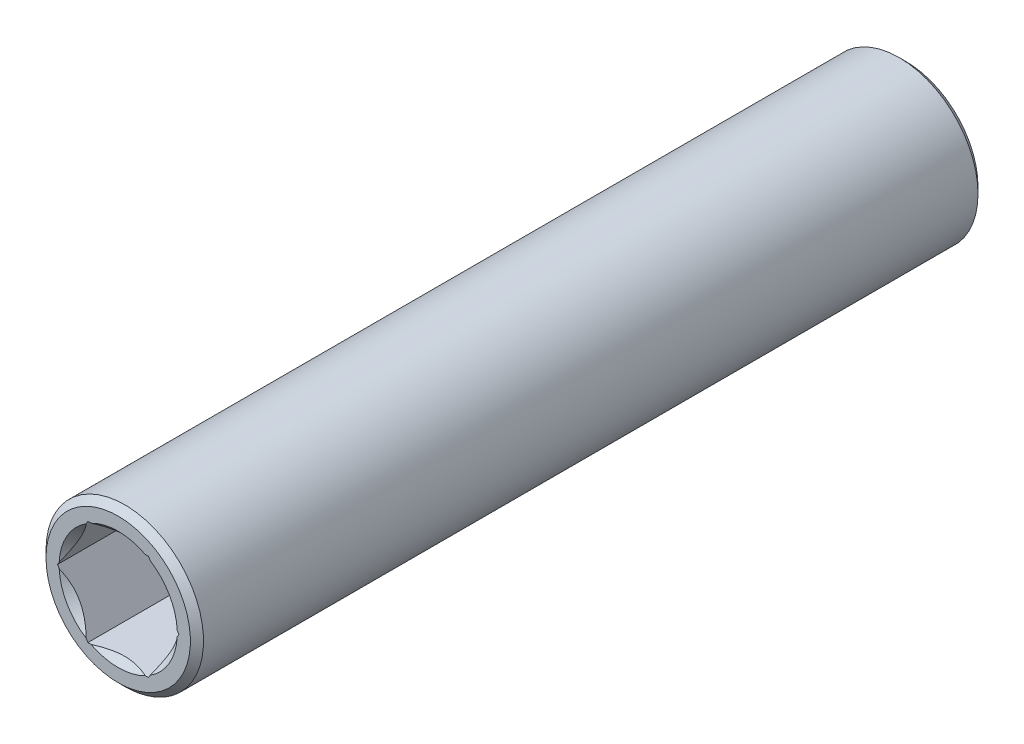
ISO-10303-21;
HEADER;
FILE_DESCRIPTION(('STEP AP214'),'2;1');
FILE_NAME('part.step','',(''),(''),'','','');
FILE_SCHEMA(('AUTOMOTIVE_DESIGN { 1 0 10303 214 1 1 1 1 }'));
ENDSEC;
DATA;
#1=APPLICATION_CONTEXT('core data for automotive mechanical design processes');
#2=APPLICATION_PROTOCOL_DEFINITION('international standard','automotive_design',2000,#1);
#3=PRODUCT_CONTEXT('',#1,'mechanical');
#4=PRODUCT('Part','Part','',(#3));
#5=PRODUCT_RELATED_PRODUCT_CATEGORY('part','',(#4));
#6=PRODUCT_DEFINITION_FORMATION('','',#4);
#7=PRODUCT_DEFINITION_CONTEXT('part definition',#1,'design');
#8=PRODUCT_DEFINITION('design','',#6,#7);
#9=PRODUCT_DEFINITION_SHAPE('','',#8);
#10=(LENGTH_UNIT() NAMED_UNIT(*) SI_UNIT(.MILLI.,.METRE.));
#11=(NAMED_UNIT(*) PLANE_ANGLE_UNIT() SI_UNIT($,.RADIAN.));
#12=(NAMED_UNIT(*) SI_UNIT($,.STERADIAN.) SOLID_ANGLE_UNIT());
#13=UNCERTAINTY_MEASURE_WITH_UNIT(LENGTH_MEASURE(1.E-05),#10,'distance_accuracy_value','');
#14=(GEOMETRIC_REPRESENTATION_CONTEXT(3) GLOBAL_UNCERTAINTY_ASSIGNED_CONTEXT((#13)) GLOBAL_UNIT_ASSIGNED_CONTEXT((#10,
#11,#12)) REPRESENTATION_CONTEXT('',''));
#15=CARTESIAN_POINT('',(0.,0.,0.));
#16=DIRECTION('',(0.,0.,1.));
#17=DIRECTION('',(1.,0.,0.));
#18=AXIS2_PLACEMENT_3D('',#15,#16,#17);
#19=CARTESIAN_POINT('',(0.,0.,0.));
#20=DIRECTION('',(0.,0.,-1.));
#21=DIRECTION('',(-1.,0.,0.));
#22=AXIS2_PLACEMENT_3D('',#19,#20,#21);
#23=CYLINDRICAL_SURFACE('',#22,2.5);
#24=CARTESIAN_POINT('',(0.,0.,-30.));
#25=DIRECTION('',(0.,0.,-1.));
#26=DIRECTION('',(-1.,0.,0.));
#27=AXIS2_PLACEMENT_3D('',#24,#25,#26);
#28=CIRCLE('',#27,2.5);
#29=CARTESIAN_POINT('',(-2.5,0.,-30.));
#30=VERTEX_POINT('',#29);
#31=EDGE_CURVE('P0_E15',#30,#30,#28,.F.);
#32=ORIENTED_EDGE('',*,*,#31,.T.);
#33=EDGE_LOOP('',(#32));
#34=FACE_BOUND('',#33,.T.);
#35=CARTESIAN_POINT('',(0.,0.,0.));
#36=DIRECTION('',(0.,0.,-1.));
#37=DIRECTION('',(-1.,0.,0.));
#38=AXIS2_PLACEMENT_3D('',#35,#36,#37);
#39=CIRCLE('',#38,2.5);
#40=CARTESIAN_POINT('',(-2.5,0.,0.));
#41=VERTEX_POINT('',#40);
#42=EDGE_CURVE('P0_E10',#41,#41,#39,.T.);
#43=ORIENTED_EDGE('',*,*,#42,.T.);
#44=EDGE_LOOP('',(#43));
#45=FACE_BOUND('',#44,.T.);
#46=ADVANCED_FACE('P0_F14',(#34,#45),#23,.T.);
#47=OPEN_SHELL('',(#46));
#48=SHELL_BASED_SURFACE_MODEL('P0_B1',(#47));
#49=CARTESIAN_POINT('',(0.,0.,-4.));
#50=DIRECTION('',(0.,0.,1.));
#51=DIRECTION('',(1.,0.,0.));
#52=AXIS2_PLACEMENT_3D('',#49,#50,#51);
#53=PLANE('',#52);
#54=DIRECTION('',(-0.500000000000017,-0.866025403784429,0.));
#55=VECTOR('',#54,1.);
#56=CARTESIAN_POINT('',(-1.154700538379,2.,-4.));
#57=LINE('',#56,#55);
#58=CARTESIAN_POINT('',(-1.154700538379,2.,-4.));
#59=VERTEX_POINT('',#58);
#60=CARTESIAN_POINT('',(-2.30940107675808,0.,-4.));
#61=VERTEX_POINT('',#60);
#62=EDGE_CURVE('P1_E411',#59,#61,#57,.T.);
#63=ORIENTED_EDGE('',*,*,#62,.T.);
#64=DIRECTION('',(0.500000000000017,-0.866025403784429,0.));
#65=VECTOR('',#64,1.);
#66=CARTESIAN_POINT('',(-2.309401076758,0.,-4.));
#67=LINE('',#66,#65);
#68=CARTESIAN_POINT('',(-1.15470053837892,-1.99999999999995,-4.));
#69=VERTEX_POINT('',#68);
#70=EDGE_CURVE('P1_E177',#61,#69,#67,.T.);
#71=ORIENTED_EDGE('',*,*,#70,.T.);
#72=DIRECTION('',(1.,0.,0.));
#73=VECTOR('',#72,1.);
#74=CARTESIAN_POINT('',(-1.154700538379,-2.,-4.));
#75=LINE('',#74,#73);
#76=CARTESIAN_POINT('',(1.154700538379,-2.,-4.));
#77=VERTEX_POINT('',#76);
#78=EDGE_CURVE('P1_E166',#69,#77,#75,.T.);
#79=ORIENTED_EDGE('',*,*,#78,.T.);
#80=DIRECTION('',(0.500000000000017,0.866025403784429,0.));
#81=VECTOR('',#80,1.);
#82=CARTESIAN_POINT('',(1.154700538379,-2.,-4.));
#83=LINE('',#82,#81);
#84=CARTESIAN_POINT('',(2.30940107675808,0.,-4.));
#85=VERTEX_POINT('',#84);
#86=EDGE_CURVE('P1_E155',#77,#85,#83,.T.);
#87=ORIENTED_EDGE('',*,*,#86,.T.);
#88=DIRECTION('',(-0.500000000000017,0.866025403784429,0.));
#89=VECTOR('',#88,1.);
#90=CARTESIAN_POINT('',(2.309401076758,0.,-4.));
#91=LINE('',#90,#89);
#92=CARTESIAN_POINT('',(1.15470053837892,1.99999999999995,-4.));
#93=VERTEX_POINT('',#92);
#94=EDGE_CURVE('P1_E133',#85,#93,#91,.T.);
#95=ORIENTED_EDGE('',*,*,#94,.T.);
#96=DIRECTION('',(1.,0.,0.));
#97=VECTOR('',#96,1.);
#98=CARTESIAN_POINT('',(1.154700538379,2.,-4.));
#99=LINE('',#98,#97);
#100=EDGE_CURVE('P1_E137',#93,#59,#99,.F.);
#101=ORIENTED_EDGE('',*,*,#100,.T.);
#102=EDGE_LOOP('',(#63,#71,#79,#87,#95,#101));
#103=FACE_BOUND('',#102,.T.);
#104=ADVANCED_FACE('P1_F16',(#103),#53,.T.);
#105=CARTESIAN_POINT('',(-1.154700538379,2.,0.));
#106=DIRECTION('',(-0.866025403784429,0.500000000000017,0.));
#107=DIRECTION('',(-0.500000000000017,-0.866025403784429,0.));
#108=AXIS2_PLACEMENT_3D('',#105,#106,#107);
#109=PLANE('',#108);
#110=DIRECTION('',(0.,0.,1.));
#111=VECTOR('',#110,1.);
#112=CARTESIAN_POINT('',(-2.309401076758,0.,0.));
#113=LINE('',#112,#111);
#114=CARTESIAN_POINT('',(-2.30940107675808,0.,0.));
#115=VERTEX_POINT('',#114);
#116=EDGE_CURVE('P1_E180',#115,#61,#113,.F.);
#117=ORIENTED_EDGE('',*,*,#116,.T.);
#118=ORIENTED_EDGE('',*,*,#62,.F.);
#119=DIRECTION('',(0.,0.,1.));
#120=VECTOR('',#119,1.);
#121=CARTESIAN_POINT('',(-1.154700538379,2.,0.));
#122=LINE('',#121,#120);
#123=CARTESIAN_POINT('',(-1.154700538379,2.,0.));
#124=VERTEX_POINT('',#123);
#125=EDGE_CURVE('P1_E139',#59,#124,#122,.T.);
#126=ORIENTED_EDGE('',*,*,#125,.T.);
#127=DIRECTION('',(-0.500000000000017,-0.866025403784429,0.));
#128=VECTOR('',#127,1.);
#129=CARTESIAN_POINT('',(-1.154700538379,2.,0.));
#130=LINE('',#129,#128);
#131=CARTESIAN_POINT('',(-1.21666260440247,1.89267855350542,2.00448068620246E-11));
#132=VERTEX_POINT('',#131);
#133=EDGE_CURVE('P1_E74',#132,#124,#130,.F.);
#134=ORIENTED_EDGE('',*,*,#133,.F.);
#135=CARTESIAN_POINT('',(-1.21666260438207,1.89267855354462,3.92484301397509E-11));
#136=CARTESIAN_POINT('',(-1.25297293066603,1.82978722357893,-0.0332570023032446));
#137=CARTESIAN_POINT('',(-1.28985399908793,1.76590733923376,-0.0642848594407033));
#138=CARTESIAN_POINT('',(-1.36486667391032,1.63598157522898,-0.120580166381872));
#139=CARTESIAN_POINT('',(-1.403002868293,1.56992774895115,-0.145822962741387));
#140=CARTESIAN_POINT('',(-1.47983157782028,1.43685652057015,-0.188665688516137));
#141=CARTESIAN_POINT('',(-1.51851057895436,1.36986252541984,-0.206359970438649));
#142=CARTESIAN_POINT('',(-1.59655412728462,1.23468713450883,-0.233183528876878));
#143=CARTESIAN_POINT('',(-1.6359173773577,1.16650798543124,-0.242327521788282));
#144=CARTESIAN_POINT('',(-1.71181499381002,1.03504945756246,-0.250912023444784));
#145=CARTESIAN_POINT('',(-1.74832931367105,0.971804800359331,-0.251056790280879));
#146=CARTESIAN_POINT('',(-1.82116408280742,0.845651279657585,-0.243393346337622));
#147=CARTESIAN_POINT('',(-1.85748441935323,0.782742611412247,-0.235580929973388));
#148=CARTESIAN_POINT('',(-1.92952738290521,0.657960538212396,-0.212618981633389));
#149=CARTESIAN_POINT('',(-1.96524999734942,0.596087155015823,-0.197469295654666));
#150=CARTESIAN_POINT('',(-2.03587686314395,0.473757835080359,-0.16084210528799));
#151=CARTESIAN_POINT('',(-2.07078077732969,0.41330248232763,-0.139362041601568));
#152=CARTESIAN_POINT('',(-2.12941916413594,0.311737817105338,-0.0983618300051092));
#153=CARTESIAN_POINT('',(-2.15338910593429,0.270220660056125,-0.0801577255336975));
#154=CARTESIAN_POINT('',(-2.20079057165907,0.18811891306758,-0.0416056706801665));
#155=CARTESIAN_POINT('',(-2.22422377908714,0.147531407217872,-0.021266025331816));
#156=CARTESIAN_POINT('',(-2.24743901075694,0.107321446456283,3.99436300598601E-11));
#157=B_SPLINE_CURVE_WITH_KNOTS('',3,(#135,#136,#137,#138,#139,#140,#141,#142,#143,#144,#145,
#146,#147,#148,#149,#150,#151,#152,#153,#154,#155,#156),.UNSPECIFIED.,.F.,.F.,(4,2,2,2,2,2,2,2,
2,2,4),(0.,0.239748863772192,0.480501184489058,0.718149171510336,0.955387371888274,
1.17403444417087,1.39279713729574,1.6115644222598,1.83042027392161,1.98420700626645,
2.13741638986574),.UNSPECIFIED.);
#158=CARTESIAN_POINT('',(-2.24743901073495,0.107321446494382,2.00795536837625E-11));
#159=VERTEX_POINT('',#158);
#160=EDGE_CURVE('P1_E19',#132,#159,#157,.T.);
#161=ORIENTED_EDGE('',*,*,#160,.T.);
#162=DIRECTION('',(-0.500000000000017,-0.866025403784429,0.));
#163=VECTOR('',#162,1.);
#164=CARTESIAN_POINT('',(-1.154700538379,2.,0.));
#165=LINE('',#164,#163);
#166=EDGE_CURVE('P1_E413',#115,#159,#165,.F.);
#167=ORIENTED_EDGE('',*,*,#166,.F.);
#168=EDGE_LOOP('',(#117,#118,#126,#134,#161,#167));
#169=FACE_BOUND('',#168,.T.);
#170=ADVANCED_FACE('P1_F271',(#169),#109,.F.);
#171=CARTESIAN_POINT('',(-2.309401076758,0.,0.));
#172=DIRECTION('',(-0.866025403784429,-0.500000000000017,0.));
#173=DIRECTION('',(0.500000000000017,-0.866025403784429,0.));
#174=AXIS2_PLACEMENT_3D('',#171,#172,#173);
#175=PLANE('',#174);
#176=DIRECTION('',(0.,0.,-1.));
#177=VECTOR('',#176,1.);
#178=CARTESIAN_POINT('',(-1.154700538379,-2.,0.));
#179=LINE('',#178,#177);
#180=CARTESIAN_POINT('',(-1.15470053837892,-1.99999999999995,0.));
#181=VERTEX_POINT('',#180);
#182=EDGE_CURVE('P1_E169',#181,#69,#179,.T.);
#183=ORIENTED_EDGE('',*,*,#182,.T.);
#184=ORIENTED_EDGE('',*,*,#70,.F.);
#185=ORIENTED_EDGE('',*,*,#116,.F.);
#186=DIRECTION('',(0.500000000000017,-0.866025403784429,0.));
#187=VECTOR('',#186,1.);
#188=CARTESIAN_POINT('',(-2.309401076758,0.,0.));
#189=LINE('',#188,#187);
#190=CARTESIAN_POINT('',(-2.24743901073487,-0.107321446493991,1.99833493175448E-11));
#191=VERTEX_POINT('',#190);
#192=EDGE_CURVE('P1_E185',#191,#115,#189,.F.);
#193=ORIENTED_EDGE('',*,*,#192,.F.);
#194=CARTESIAN_POINT('',(-2.2474390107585,-0.107321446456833,3.91484602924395E-11));
#195=CARTESIAN_POINT('',(-2.21112868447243,-0.170212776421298,-0.0332570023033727));
#196=CARTESIAN_POINT('',(-2.17424761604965,-0.234092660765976,-0.0642848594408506));
#197=CARTESIAN_POINT('',(-2.09923494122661,-0.364018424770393,-0.12058016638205));
#198=CARTESIAN_POINT('',(-2.06109874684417,-0.430072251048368,-0.145822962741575));
#199=CARTESIAN_POINT('',(-1.98427003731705,-0.56314347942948,-0.188665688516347));
#200=CARTESIAN_POINT('',(-1.9455910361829,-0.63013747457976,-0.206359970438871));
#201=CARTESIAN_POINT('',(-1.86754748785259,-0.765312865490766,-0.233183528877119));
#202=CARTESIAN_POINT('',(-1.82818423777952,-0.833492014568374,-0.24232752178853));
#203=CARTESIAN_POINT('',(-1.7522866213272,-0.964950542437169,-0.250912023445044));
#204=CARTESIAN_POINT('',(-1.71577230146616,-1.0281951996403,-0.251056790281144));
#205=CARTESIAN_POINT('',(-1.64293753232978,-1.15434872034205,-0.243393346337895));
#206=CARTESIAN_POINT('',(-1.60661719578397,-1.2172573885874,-0.235580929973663));
#207=CARTESIAN_POINT('',(-1.53457423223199,-1.34203946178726,-0.212618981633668));
#208=CARTESIAN_POINT('',(-1.49885161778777,-1.40391284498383,-0.197469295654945));
#209=CARTESIAN_POINT('',(-1.42822475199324,-1.5262421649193,-0.160842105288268));
#210=CARTESIAN_POINT('',(-1.3933208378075,-1.58669751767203,-0.139362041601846));
#211=CARTESIAN_POINT('',(-1.33468245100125,-1.68826218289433,-0.0983618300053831));
#212=CARTESIAN_POINT('',(-1.31071250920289,-1.72977933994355,-0.0801577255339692));
#213=CARTESIAN_POINT('',(-1.26331104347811,-1.8118810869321,-0.0416056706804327));
#214=CARTESIAN_POINT('',(-1.23987783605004,-1.85246859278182,-0.0212660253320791));
#215=CARTESIAN_POINT('',(-1.21666260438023,-1.89267855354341,3.96839969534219E-11));
#216=B_SPLINE_CURVE_WITH_KNOTS('',3,(#194,#195,#196,#197,#198,#199,#200,#201,#202,#203,#204,
#205,#206,#207,#208,#209,#210,#211,#212,#213,#214,#215),.UNSPECIFIED.,.F.,.F.,(4,2,2,2,2,2,2,2,
2,2,4),(0.,0.239748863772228,0.48050118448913,0.718149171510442,0.955387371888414,
1.17403444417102,1.3927971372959,1.61156442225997,1.8304202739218,1.98420700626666,
2.13741638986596),.UNSPECIFIED.);
#217=CARTESIAN_POINT('',(-1.21666260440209,-1.89267855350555,1.99485061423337E-11));
#218=VERTEX_POINT('',#217);
#219=EDGE_CURVE('P1_E274',#191,#218,#216,.T.);
#220=ORIENTED_EDGE('',*,*,#219,.T.);
#221=DIRECTION('',(0.500000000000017,-0.866025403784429,0.));
#222=VECTOR('',#221,1.);
#223=CARTESIAN_POINT('',(-2.309401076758,0.,0.));
#224=LINE('',#223,#222);
#225=EDGE_CURVE('P1_E179',#181,#218,#224,.F.);
#226=ORIENTED_EDGE('',*,*,#225,.F.);
#227=EDGE_LOOP('',(#183,#184,#185,#193,#220,#226));
#228=FACE_BOUND('',#227,.T.);
#229=ADVANCED_FACE('P1_F267',(#228),#175,.F.);
#230=CARTESIAN_POINT('',(-1.154700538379,-2.,0.));
#231=DIRECTION('',(0.,-1.,0.));
#232=DIRECTION('',(0.,0.,-1.));
#233=AXIS2_PLACEMENT_3D('',#230,#231,#232);
#234=PLANE('',#233);
#235=DIRECTION('',(0.,0.,1.));
#236=VECTOR('',#235,1.);
#237=CARTESIAN_POINT('',(1.154700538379,-2.,0.));
#238=LINE('',#237,#236);
#239=CARTESIAN_POINT('',(1.154700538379,-2.,0.));
#240=VERTEX_POINT('',#239);
#241=EDGE_CURVE('P1_E158',#240,#77,#238,.F.);
#242=ORIENTED_EDGE('',*,*,#241,.T.);
#243=ORIENTED_EDGE('',*,*,#78,.F.);
#244=ORIENTED_EDGE('',*,*,#182,.F.);
#245=DIRECTION('',(1.,0.,0.));
#246=VECTOR('',#245,1.);
#247=CARTESIAN_POINT('',(-1.154700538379,-2.,0.));
#248=LINE('',#247,#246);
#249=CARTESIAN_POINT('',(-1.03077640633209,-2.,2.00700850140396E-11));
#250=VERTEX_POINT('',#249);
#251=EDGE_CURVE('P1_E174',#250,#181,#248,.F.);
#252=ORIENTED_EDGE('',*,*,#251,.F.);
#253=CARTESIAN_POINT('',(-1.03077640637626,-2.00000000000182,3.93492905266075E-11));
#254=CARTESIAN_POINT('',(-0.958155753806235,-2.00000000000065,-0.0332570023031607));
#255=CARTESIAN_POINT('',(-0.88439361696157,-2.00000000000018,-0.0642848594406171));
#256=CARTESIAN_POINT('',(-0.734368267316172,-1.99999999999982,-0.120580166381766));
#257=CARTESIAN_POINT('',(-0.658095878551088,-1.99999999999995,-0.145822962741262));
#258=CARTESIAN_POINT('',(-0.504438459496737,-2.00000000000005,-0.188665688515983));
#259=CARTESIAN_POINT('',(-0.427080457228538,-2.00000000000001,-0.206359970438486));
#260=CARTESIAN_POINT('',(-0.270993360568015,-1.99999999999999,-0.233183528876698));
#261=CARTESIAN_POINT('',(-0.192266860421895,-2.,-0.242327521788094));
#262=CARTESIAN_POINT('',(-0.0404716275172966,-2.,-0.250912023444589));
#263=CARTESIAN_POINT('',(0.0325570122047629,-2.,-0.251056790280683));
#264=CARTESIAN_POINT('',(0.178226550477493,-2.,-0.243393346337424));
#265=CARTESIAN_POINT('',(0.2508672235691,-2.,-0.235580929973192));
#266=CARTESIAN_POINT('',(0.394953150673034,-2.,-0.212618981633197));
#267=CARTESIAN_POINT('',(0.466398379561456,-2.,-0.197469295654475));
#268=CARTESIAN_POINT('',(0.607652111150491,-2.,-0.160842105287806));
#269=CARTESIAN_POINT('',(0.67745993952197,-2.,-0.139362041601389));
#270=CARTESIAN_POINT('',(0.794736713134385,-2.,-0.0983618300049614));
#271=CARTESIAN_POINT('',(0.84267659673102,-2.,-0.0801577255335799));
#272=CARTESIAN_POINT('',(0.93747952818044,-2.,-0.0416056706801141));
#273=CARTESIAN_POINT('',(0.984345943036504,-2.,-0.0212660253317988));
#274=CARTESIAN_POINT('',(1.03077640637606,-2.,3.99241774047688E-11));
#275=B_SPLINE_CURVE_WITH_KNOTS('',3,(#253,#254,#255,#256,#257,#258,#259,#260,#261,#262,#263,
#264,#265,#266,#267,#268,#269,#270,#271,#272,#273,#274),.UNSPECIFIED.,.F.,.F.,(4,2,2,2,2,2,2,2,
2,2,4),(0.,0.239748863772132,0.480501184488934,0.718149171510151,0.95538737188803,
1.1740344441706,1.39279713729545,1.61156442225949,1.83042027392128,1.9842070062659,
2.13741638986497),.UNSPECIFIED.);
#276=CARTESIAN_POINT('',(1.03077640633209,-2.,2.00699398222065E-11));
#277=VERTEX_POINT('',#276);
#278=EDGE_CURVE('P1_E252',#250,#277,#275,.T.);
#279=ORIENTED_EDGE('',*,*,#278,.T.);
#280=DIRECTION('',(1.,0.,0.));
#281=VECTOR('',#280,1.);
#282=CARTESIAN_POINT('',(-1.154700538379,-2.,0.));
#283=LINE('',#282,#281);
#284=EDGE_CURVE('P1_E168',#240,#277,#283,.F.);
#285=ORIENTED_EDGE('',*,*,#284,.F.);
#286=EDGE_LOOP('',(#242,#243,#244,#252,#279,#285));
#287=FACE_BOUND('',#286,.T.);
#288=ADVANCED_FACE('P1_F261',(#287),#234,.F.);
#289=CARTESIAN_POINT('',(1.154700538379,-2.,0.));
#290=DIRECTION('',(0.866025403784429,-0.500000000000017,0.));
#291=DIRECTION('',(0.500000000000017,0.866025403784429,0.));
#292=AXIS2_PLACEMENT_3D('',#289,#290,#291);
#293=PLANE('',#292);
#294=DIRECTION('',(0.,0.,1.));
#295=VECTOR('',#294,1.);
#296=CARTESIAN_POINT('',(2.309401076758,0.,0.));
#297=LINE('',#296,#295);
#298=CARTESIAN_POINT('',(2.30940107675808,0.,0.));
#299=VERTEX_POINT('',#298);
#300=EDGE_CURVE('P1_E147',#299,#85,#297,.F.);
#301=ORIENTED_EDGE('',*,*,#300,.T.);
#302=ORIENTED_EDGE('',*,*,#86,.F.);
#303=ORIENTED_EDGE('',*,*,#241,.F.);
#304=DIRECTION('',(0.500000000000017,0.866025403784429,0.));
#305=VECTOR('',#304,1.);
#306=CARTESIAN_POINT('',(1.154700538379,-2.,0.));
#307=LINE('',#306,#305);
#308=CARTESIAN_POINT('',(1.21666260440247,-1.89267855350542,2.00449157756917E-11));
#309=VERTEX_POINT('',#308);
#310=EDGE_CURVE('P1_E163',#309,#240,#307,.F.);
#311=ORIENTED_EDGE('',*,*,#310,.F.);
#312=CARTESIAN_POINT('',(1.21666260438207,-1.89267855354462,3.92481205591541E-11));
#313=CARTESIAN_POINT('',(1.25297293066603,-1.82978722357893,-0.033257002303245));
#314=CARTESIAN_POINT('',(1.28985399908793,-1.76590733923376,-0.0642848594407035));
#315=CARTESIAN_POINT('',(1.36486667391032,-1.63598157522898,-0.120580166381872));
#316=CARTESIAN_POINT('',(1.403002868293,-1.56992774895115,-0.145822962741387));
#317=CARTESIAN_POINT('',(1.47983157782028,-1.43685652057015,-0.188665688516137));
#318=CARTESIAN_POINT('',(1.51851057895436,-1.36986252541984,-0.206359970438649));
#319=CARTESIAN_POINT('',(1.59655412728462,-1.23468713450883,-0.233183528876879));
#320=CARTESIAN_POINT('',(1.6359173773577,-1.16650798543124,-0.242327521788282));
#321=CARTESIAN_POINT('',(1.71181499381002,-1.03504945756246,-0.250912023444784));
#322=CARTESIAN_POINT('',(1.74832931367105,-0.971804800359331,-0.251056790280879));
#323=CARTESIAN_POINT('',(1.82116408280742,-0.845651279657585,-0.243393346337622));
#324=CARTESIAN_POINT('',(1.85748441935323,-0.782742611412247,-0.235580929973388));
#325=CARTESIAN_POINT('',(1.92952738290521,-0.657960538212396,-0.212618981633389));
#326=CARTESIAN_POINT('',(1.96524999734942,-0.596087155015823,-0.197469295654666));
#327=CARTESIAN_POINT('',(2.03587686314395,-0.473757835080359,-0.16084210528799));
#328=CARTESIAN_POINT('',(2.07078077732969,-0.41330248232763,-0.139362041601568));
#329=CARTESIAN_POINT('',(2.12941916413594,-0.311737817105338,-0.0983618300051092));
#330=CARTESIAN_POINT('',(2.15338910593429,-0.270220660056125,-0.0801577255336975));
#331=CARTESIAN_POINT('',(2.20079057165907,-0.18811891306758,-0.0416056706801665));
#332=CARTESIAN_POINT('',(2.22422377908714,-0.147531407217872,-0.021266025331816));
#333=CARTESIAN_POINT('',(2.24743901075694,-0.107321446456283,3.99436300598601E-11));
#334=B_SPLINE_CURVE_WITH_KNOTS('',3,(#312,#313,#314,#315,#316,#317,#318,#319,#320,#321,#322,
#323,#324,#325,#326,#327,#328,#329,#330,#331,#332,#333),.UNSPECIFIED.,.F.,.F.,(4,2,2,2,2,2,2,2,
2,2,4),(0.,0.239748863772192,0.480501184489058,0.718149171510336,0.955387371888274,
1.17403444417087,1.39279713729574,1.6115644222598,1.83042027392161,1.98420700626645,
2.13741638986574),.UNSPECIFIED.);
#335=CARTESIAN_POINT('',(2.24743901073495,-0.107321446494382,2.00795470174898E-11));
#336=VERTEX_POINT('',#335);
#337=EDGE_CURVE('P1_E244',#309,#336,#334,.T.);
#338=ORIENTED_EDGE('',*,*,#337,.T.);
#339=DIRECTION('',(0.500000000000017,0.866025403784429,0.));
#340=VECTOR('',#339,1.);
#341=CARTESIAN_POINT('',(1.154700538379,-2.,0.));
#342=LINE('',#341,#340);
#343=EDGE_CURVE('P1_E157',#299,#336,#342,.F.);
#344=ORIENTED_EDGE('',*,*,#343,.F.);
#345=EDGE_LOOP('',(#301,#302,#303,#311,#338,#344));
#346=FACE_BOUND('',#345,.T.);
#347=ADVANCED_FACE('P1_F258',(#346),#293,.F.);
#348=CARTESIAN_POINT('',(2.309401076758,0.,0.));
#349=DIRECTION('',(0.866025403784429,0.500000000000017,0.));
#350=DIRECTION('',(-0.500000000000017,0.866025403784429,0.));
#351=AXIS2_PLACEMENT_3D('',#348,#349,#350);
#352=PLANE('',#351);
#353=DIRECTION('',(0.,0.,1.));
#354=VECTOR('',#353,1.);
#355=CARTESIAN_POINT('',(1.154700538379,2.,0.));
#356=LINE('',#355,#354);
#357=CARTESIAN_POINT('',(1.15470053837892,1.99999999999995,0.));
#358=VERTEX_POINT('',#357);
#359=EDGE_CURVE('P1_E123',#358,#93,#356,.F.);
#360=ORIENTED_EDGE('',*,*,#359,.T.);
#361=ORIENTED_EDGE('',*,*,#94,.F.);
#362=ORIENTED_EDGE('',*,*,#300,.F.);
#363=DIRECTION('',(-0.500000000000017,0.866025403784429,0.));
#364=VECTOR('',#363,1.);
#365=CARTESIAN_POINT('',(2.309401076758,0.,0.));
#366=LINE('',#365,#364);
#367=CARTESIAN_POINT('',(2.24743901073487,0.107321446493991,1.99833403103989E-11));
#368=VERTEX_POINT('',#367);
#369=EDGE_CURVE('P1_E152',#368,#299,#366,.F.);
#370=ORIENTED_EDGE('',*,*,#369,.F.);
#371=CARTESIAN_POINT('',(2.2474390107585,0.107321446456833,3.91484332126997E-11));
#372=CARTESIAN_POINT('',(2.21112868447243,0.170212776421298,-0.0332570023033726));
#373=CARTESIAN_POINT('',(2.17424761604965,0.234092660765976,-0.0642848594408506));
#374=CARTESIAN_POINT('',(2.09923494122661,0.364018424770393,-0.12058016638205));
#375=CARTESIAN_POINT('',(2.06109874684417,0.430072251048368,-0.145822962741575));
#376=CARTESIAN_POINT('',(1.98427003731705,0.56314347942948,-0.188665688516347));
#377=CARTESIAN_POINT('',(1.9455910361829,0.63013747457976,-0.20635997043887));
#378=CARTESIAN_POINT('',(1.86754748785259,0.765312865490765,-0.233183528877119));
#379=CARTESIAN_POINT('',(1.82818423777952,0.833492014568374,-0.24232752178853));
#380=CARTESIAN_POINT('',(1.7522866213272,0.964950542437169,-0.250912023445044));
#381=CARTESIAN_POINT('',(1.71577230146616,1.0281951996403,-0.251056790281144));
#382=CARTESIAN_POINT('',(1.64293753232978,1.15434872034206,-0.243393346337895));
#383=CARTESIAN_POINT('',(1.60661719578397,1.2172573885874,-0.235580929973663));
#384=CARTESIAN_POINT('',(1.53457423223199,1.34203946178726,-0.212618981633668));
#385=CARTESIAN_POINT('',(1.49885161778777,1.40391284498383,-0.197469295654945));
#386=CARTESIAN_POINT('',(1.42822475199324,1.5262421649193,-0.160842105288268));
#387=CARTESIAN_POINT('',(1.3933208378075,1.58669751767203,-0.139362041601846));
#388=CARTESIAN_POINT('',(1.33468245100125,1.68826218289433,-0.0983618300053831));
#389=CARTESIAN_POINT('',(1.31071250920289,1.72977933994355,-0.0801577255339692));
#390=CARTESIAN_POINT('',(1.26331104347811,1.8118810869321,-0.0416056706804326));
#391=CARTESIAN_POINT('',(1.23987783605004,1.85246859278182,-0.0212660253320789));
#392=CARTESIAN_POINT('',(1.21666260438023,1.89267855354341,3.96842650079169E-11));
#393=B_SPLINE_CURVE_WITH_KNOTS('',3,(#371,#372,#373,#374,#375,#376,#377,#378,#379,#380,#381,
#382,#383,#384,#385,#386,#387,#388,#389,#390,#391,#392),.UNSPECIFIED.,.F.,.F.,(4,2,2,2,2,2,2,2,
2,2,4),(0.,0.239748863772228,0.48050118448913,0.718149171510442,0.955387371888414,
1.17403444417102,1.3927971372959,1.61156442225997,1.8304202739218,1.98420700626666,
2.13741638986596),.UNSPECIFIED.);
#394=CARTESIAN_POINT('',(1.21666260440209,1.89267855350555,1.99485061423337E-11));
#395=VERTEX_POINT('',#394);
#396=EDGE_CURVE('P1_E131',#368,#395,#393,.T.);
#397=ORIENTED_EDGE('',*,*,#396,.T.);
#398=DIRECTION('',(-0.500000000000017,0.866025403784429,0.));
#399=VECTOR('',#398,1.);
#400=CARTESIAN_POINT('',(2.309401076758,0.,0.));
#401=LINE('',#400,#399);
#402=EDGE_CURVE('P1_E116',#358,#395,#401,.F.);
#403=ORIENTED_EDGE('',*,*,#402,.F.);
#404=EDGE_LOOP('',(#360,#361,#362,#370,#397,#403));
#405=FACE_BOUND('',#404,.T.);
#406=ADVANCED_FACE('P1_F127',(#405),#352,.F.);
#407=CARTESIAN_POINT('',(1.154700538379,2.,0.));
#408=DIRECTION('',(0.,1.,0.));
#409=DIRECTION('',(0.,0.,1.));
#410=AXIS2_PLACEMENT_3D('',#407,#408,#409);
#411=PLANE('',#410);
#412=ORIENTED_EDGE('',*,*,#125,.F.);
#413=ORIENTED_EDGE('',*,*,#100,.F.);
#414=ORIENTED_EDGE('',*,*,#359,.F.);
#415=DIRECTION('',(1.,0.,0.));
#416=VECTOR('',#415,1.);
#417=CARTESIAN_POINT('',(1.154700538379,2.,0.));
#418=LINE('',#417,#416);
#419=CARTESIAN_POINT('',(1.03077640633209,2.,2.00700850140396E-11));
#420=VERTEX_POINT('',#419);
#421=EDGE_CURVE('P1_E111',#420,#358,#418,.T.);
#422=ORIENTED_EDGE('',*,*,#421,.F.);
#423=CARTESIAN_POINT('',(1.03077640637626,2.00000000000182,3.93494114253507E-11));
#424=CARTESIAN_POINT('',(0.958155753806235,2.00000000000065,-0.0332570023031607));
#425=CARTESIAN_POINT('',(0.88439361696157,2.00000000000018,-0.0642848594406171));
#426=CARTESIAN_POINT('',(0.734368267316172,1.99999999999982,-0.120580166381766));
#427=CARTESIAN_POINT('',(0.658095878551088,1.99999999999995,-0.145822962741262));
#428=CARTESIAN_POINT('',(0.504438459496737,2.00000000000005,-0.188665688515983));
#429=CARTESIAN_POINT('',(0.427080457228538,2.00000000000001,-0.206359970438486));
#430=CARTESIAN_POINT('',(0.270993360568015,1.99999999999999,-0.233183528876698));
#431=CARTESIAN_POINT('',(0.192266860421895,2.,-0.242327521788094));
#432=CARTESIAN_POINT('',(0.0404716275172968,2.,-0.250912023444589));
#433=CARTESIAN_POINT('',(-0.0325570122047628,2.,-0.251056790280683));
#434=CARTESIAN_POINT('',(-0.178226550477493,2.,-0.243393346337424));
#435=CARTESIAN_POINT('',(-0.2508672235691,2.,-0.235580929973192));
#436=CARTESIAN_POINT('',(-0.394953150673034,2.,-0.212618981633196));
#437=CARTESIAN_POINT('',(-0.466398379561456,2.,-0.197469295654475));
#438=CARTESIAN_POINT('',(-0.607652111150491,2.,-0.160842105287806));
#439=CARTESIAN_POINT('',(-0.67745993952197,2.,-0.139362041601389));
#440=CARTESIAN_POINT('',(-0.794736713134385,2.,-0.0983618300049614));
#441=CARTESIAN_POINT('',(-0.84267659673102,2.,-0.0801577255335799));
#442=CARTESIAN_POINT('',(-0.93747952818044,2.,-0.0416056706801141));
#443=CARTESIAN_POINT('',(-0.984345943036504,2.,-0.0212660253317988));
#444=CARTESIAN_POINT('',(-1.03077640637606,2.,3.99241781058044E-11));
#445=B_SPLINE_CURVE_WITH_KNOTS('',3,(#423,#424,#425,#426,#427,#428,#429,#430,#431,#432,#433,
#434,#435,#436,#437,#438,#439,#440,#441,#442,#443,#444),.UNSPECIFIED.,.F.,.F.,(4,2,2,2,2,2,2,2,
2,2,4),(0.,0.239748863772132,0.480501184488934,0.718149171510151,0.95538737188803,
1.1740344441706,1.39279713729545,1.61156442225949,1.83042027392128,1.9842070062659,
2.13741638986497),.UNSPECIFIED.);
#446=CARTESIAN_POINT('',(-1.03077640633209,2.,2.00699360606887E-11));
#447=VERTEX_POINT('',#446);
#448=EDGE_CURVE('P1_E209',#420,#447,#445,.T.);
#449=ORIENTED_EDGE('',*,*,#448,.T.);
#450=DIRECTION('',(1.,0.,0.));
#451=VECTOR('',#450,1.);
#452=CARTESIAN_POINT('',(1.154700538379,2.,0.));
#453=LINE('',#452,#451);
#454=EDGE_CURVE('P1_E39',#124,#447,#453,.T.);
#455=ORIENTED_EDGE('',*,*,#454,.F.);
#456=EDGE_LOOP('',(#412,#413,#414,#422,#449,#455));
#457=FACE_BOUND('',#456,.T.);
#458=ADVANCED_FACE('P1_F136',(#457),#411,.F.);
#459=CARTESIAN_POINT('',(0.,0.,0.));
#460=DIRECTION('',(0.,0.,1.));
#461=DIRECTION('',(1.,0.,0.));
#462=AXIS2_PLACEMENT_3D('',#459,#460,#461);
#463=CONICAL_SURFACE('',#462,2.2499999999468,0.785398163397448);
#464=ORIENTED_EDGE('',*,*,#160,.F.);
#465=CARTESIAN_POINT('',(0.,0.,0.));
#466=DIRECTION('',(0.,0.,1.));
#467=DIRECTION('',(1.,0.,0.));
#468=AXIS2_PLACEMENT_3D('',#465,#466,#467);
#469=CIRCLE('',#468,2.2499999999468);
#470=EDGE_CURVE('P1_E206',#132,#159,#469,.T.);
#471=ORIENTED_EDGE('',*,*,#470,.T.);
#472=EDGE_LOOP('',(#464,#471));
#473=FACE_BOUND('',#472,.T.);
#474=ADVANCED_FACE('P1_F283',(#473),#463,.F.);
#475=CARTESIAN_POINT('',(0.,0.,0.));
#476=DIRECTION('',(0.,0.,1.));
#477=DIRECTION('',(1.,0.,0.));
#478=AXIS2_PLACEMENT_3D('',#475,#476,#477);
#479=CONICAL_SURFACE('',#478,2.2499999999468,0.785398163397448);
#480=ORIENTED_EDGE('',*,*,#219,.F.);
#481=CARTESIAN_POINT('',(0.,0.,0.));
#482=DIRECTION('',(0.,0.,1.));
#483=DIRECTION('',(1.,0.,0.));
#484=AXIS2_PLACEMENT_3D('',#481,#482,#483);
#485=CIRCLE('',#484,2.2499999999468);
#486=EDGE_CURVE('P1_E203',#191,#218,#485,.T.);
#487=ORIENTED_EDGE('',*,*,#486,.T.);
#488=EDGE_LOOP('',(#480,#487));
#489=FACE_BOUND('',#488,.T.);
#490=ADVANCED_FACE('P1_F280',(#489),#479,.F.);
#491=CARTESIAN_POINT('',(0.,0.,0.));
#492=DIRECTION('',(0.,0.,1.));
#493=DIRECTION('',(1.,0.,0.));
#494=AXIS2_PLACEMENT_3D('',#491,#492,#493);
#495=CONICAL_SURFACE('',#494,2.2499999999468,0.785398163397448);
#496=ORIENTED_EDGE('',*,*,#278,.F.);
#497=CARTESIAN_POINT('',(0.,0.,0.));
#498=DIRECTION('',(0.,0.,1.));
#499=DIRECTION('',(1.,0.,0.));
#500=AXIS2_PLACEMENT_3D('',#497,#498,#499);
#501=CIRCLE('',#500,2.2499999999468);
#502=EDGE_CURVE('P1_E200',#250,#277,#501,.T.);
#503=ORIENTED_EDGE('',*,*,#502,.T.);
#504=EDGE_LOOP('',(#496,#503));
#505=FACE_BOUND('',#504,.T.);
#506=ADVANCED_FACE('P1_F240',(#505),#495,.F.);
#507=CARTESIAN_POINT('',(0.,0.,0.));
#508=DIRECTION('',(0.,0.,1.));
#509=DIRECTION('',(1.,0.,0.));
#510=AXIS2_PLACEMENT_3D('',#507,#508,#509);
#511=CONICAL_SURFACE('',#510,2.2499999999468,0.785398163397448);
#512=ORIENTED_EDGE('',*,*,#337,.F.);
#513=CARTESIAN_POINT('',(0.,0.,0.));
#514=DIRECTION('',(0.,0.,1.));
#515=DIRECTION('',(1.,0.,0.));
#516=AXIS2_PLACEMENT_3D('',#513,#514,#515);
#517=CIRCLE('',#516,2.2499999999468);
#518=EDGE_CURVE('P1_E197',#309,#336,#517,.T.);
#519=ORIENTED_EDGE('',*,*,#518,.T.);
#520=EDGE_LOOP('',(#512,#519));
#521=FACE_BOUND('',#520,.T.);
#522=ADVANCED_FACE('P1_F235',(#521),#511,.F.);
#523=CARTESIAN_POINT('',(0.,0.,0.));
#524=DIRECTION('',(0.,0.,1.));
#525=DIRECTION('',(1.,0.,0.));
#526=AXIS2_PLACEMENT_3D('',#523,#524,#525);
#527=CONICAL_SURFACE('',#526,2.2499999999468,0.785398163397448);
#528=ORIENTED_EDGE('',*,*,#396,.F.);
#529=CARTESIAN_POINT('',(0.,0.,0.));
#530=DIRECTION('',(0.,0.,1.));
#531=DIRECTION('',(1.,0.,0.));
#532=AXIS2_PLACEMENT_3D('',#529,#530,#531);
#533=CIRCLE('',#532,2.2499999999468);
#534=EDGE_CURVE('P1_E195',#368,#395,#533,.T.);
#535=ORIENTED_EDGE('',*,*,#534,.T.);
#536=EDGE_LOOP('',(#528,#535));
#537=FACE_BOUND('',#536,.T.);
#538=ADVANCED_FACE('P1_F229',(#537),#527,.F.);
#539=CARTESIAN_POINT('',(0.,0.,0.));
#540=DIRECTION('',(0.,0.,1.));
#541=DIRECTION('',(1.,0.,0.));
#542=AXIS2_PLACEMENT_3D('',#539,#540,#541);
#543=CONICAL_SURFACE('',#542,2.2499999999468,0.785398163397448);
#544=ORIENTED_EDGE('',*,*,#448,.F.);
#545=CARTESIAN_POINT('',(0.,0.,0.));
#546=DIRECTION('',(0.,0.,1.));
#547=DIRECTION('',(1.,0.,0.));
#548=AXIS2_PLACEMENT_3D('',#545,#546,#547);
#549=CIRCLE('',#548,2.2499999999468);
#550=EDGE_CURVE('P1_E119',#420,#447,#549,.T.);
#551=ORIENTED_EDGE('',*,*,#550,.T.);
#552=EDGE_LOOP('',(#544,#551));
#553=FACE_BOUND('',#552,.T.);
#554=ADVANCED_FACE('P1_F225',(#553),#543,.F.);
#555=CARTESIAN_POINT('',(0.,0.,0.));
#556=DIRECTION('',(0.,0.,-1.));
#557=DIRECTION('',(-1.,0.,0.));
#558=AXIS2_PLACEMENT_3D('',#555,#556,#557);
#559=PLANE('',#558);
#560=ORIENTED_EDGE('',*,*,#454,.T.);
#561=ORIENTED_EDGE('',*,*,#550,.F.);
#562=ORIENTED_EDGE('',*,*,#421,.T.);
#563=ORIENTED_EDGE('',*,*,#402,.T.);
#564=ORIENTED_EDGE('',*,*,#534,.F.);
#565=ORIENTED_EDGE('',*,*,#369,.T.);
#566=ORIENTED_EDGE('',*,*,#343,.T.);
#567=ORIENTED_EDGE('',*,*,#518,.F.);
#568=ORIENTED_EDGE('',*,*,#310,.T.);
#569=ORIENTED_EDGE('',*,*,#284,.T.);
#570=ORIENTED_EDGE('',*,*,#502,.F.);
#571=ORIENTED_EDGE('',*,*,#251,.T.);
#572=ORIENTED_EDGE('',*,*,#225,.T.);
#573=ORIENTED_EDGE('',*,*,#486,.F.);
#574=ORIENTED_EDGE('',*,*,#192,.T.);
#575=ORIENTED_EDGE('',*,*,#166,.T.);
#576=ORIENTED_EDGE('',*,*,#470,.F.);
#577=ORIENTED_EDGE('',*,*,#133,.T.);
#578=EDGE_LOOP('',(#560,#561,#562,#563,#564,#565,#566,#567,#568,#569,#570,#571,#572,#573,#574,
#575,#576,#577));
#579=FACE_BOUND('',#578,.T.);
#580=CARTESIAN_POINT('',(0.,0.,5.6843418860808E-11));
#581=DIRECTION('',(0.,0.,-1.));
#582=DIRECTION('',(-1.,0.,0.));
#583=AXIS2_PLACEMENT_3D('',#580,#581,#582);
#584=CIRCLE('',#583,2.74999999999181);
#585=CARTESIAN_POINT('',(-2.74999999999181,0.,5.6843418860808E-11));
#586=VERTEX_POINT('',#585);
#587=EDGE_CURVE('P1_E191',#586,#586,#584,.T.);
#588=ORIENTED_EDGE('',*,*,#587,.F.);
#589=EDGE_LOOP('',(#588));
#590=FACE_BOUND('',#589,.T.);
#591=ADVANCED_FACE('P1_F113',(#579,#590),#559,.F.);
#592=CARTESIAN_POINT('',(0.,0.,-30.));
#593=DIRECTION('',(0.,0.,-1.));
#594=DIRECTION('',(-1.,0.,0.));
#595=AXIS2_PLACEMENT_3D('',#592,#593,#594);
#596=PLANE('',#595);
#597=CARTESIAN_POINT('',(0.,0.,-30.0000000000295));
#598=DIRECTION('',(0.,0.,1.));
#599=DIRECTION('',(1.,0.,0.));
#600=AXIS2_PLACEMENT_3D('',#597,#598,#599);
#601=CIRCLE('',#600,2.74999999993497);
#602=CARTESIAN_POINT('',(2.74999999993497,0.,-30.0000000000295));
#603=VERTEX_POINT('',#602);
#604=EDGE_CURVE('P1_E188',#603,#603,#601,.T.);
#605=ORIENTED_EDGE('',*,*,#604,.F.);
#606=EDGE_LOOP('',(#605));
#607=FACE_BOUND('',#606,.T.);
#608=ADVANCED_FACE('P1_F309',(#607),#596,.T.);
#609=CARTESIAN_POINT('',(0.,0.,-0.249999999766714));
#610=DIRECTION('',(0.,0.,-1.));
#611=DIRECTION('',(-1.,0.,0.));
#612=AXIS2_PLACEMENT_3D('',#609,#610,#611);
#613=CONICAL_SURFACE('',#612,2.99999999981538,0.785398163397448);
#614=CARTESIAN_POINT('',(0.,0.,-0.25));
#615=DIRECTION('',(0.,0.,-1.));
#616=DIRECTION('',(-1.,0.,0.));
#617=AXIS2_PLACEMENT_3D('',#614,#615,#616);
#618=CIRCLE('',#617,3.);
#619=CARTESIAN_POINT('',(-3.,0.,-0.25));
#620=VERTEX_POINT('',#619);
#621=EDGE_CURVE('P1_E30',#620,#620,#618,.T.);
#622=ORIENTED_EDGE('',*,*,#621,.F.);
#623=EDGE_LOOP('',(#622));
#624=FACE_BOUND('',#623,.T.);
#625=ORIENTED_EDGE('',*,*,#587,.T.);
#626=EDGE_LOOP('',(#625));
#627=FACE_BOUND('',#626,.T.);
#628=ADVANCED_FACE('P1_F302',(#624,#627),#613,.T.);
#629=CARTESIAN_POINT('',(0.,0.,-29.7500000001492));
#630=DIRECTION('',(0.,0.,1.));
#631=DIRECTION('',(1.,0.,0.));
#632=AXIS2_PLACEMENT_3D('',#629,#630,#631);
#633=CONICAL_SURFACE('',#632,2.99999999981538,0.785398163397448);
#634=ORIENTED_EDGE('',*,*,#604,.T.);
#635=EDGE_LOOP('',(#634));
#636=FACE_BOUND('',#635,.T.);
#637=CARTESIAN_POINT('',(0.,0.,-29.75));
#638=DIRECTION('',(0.,0.,-1.));
#639=DIRECTION('',(-1.,0.,0.));
#640=AXIS2_PLACEMENT_3D('',#637,#638,#639);
#641=CIRCLE('',#640,3.);
#642=CARTESIAN_POINT('',(-3.,0.,-29.75));
#643=VERTEX_POINT('',#642);
#644=EDGE_CURVE('P1_E11',#643,#643,#641,.F.);
#645=ORIENTED_EDGE('',*,*,#644,.F.);
#646=EDGE_LOOP('',(#645));
#647=FACE_BOUND('',#646,.T.);
#648=ADVANCED_FACE('P1_F295',(#636,#647),#633,.T.);
#649=CARTESIAN_POINT('',(0.,0.,1.5));
#650=DIRECTION('',(0.,0.,-1.));
#651=DIRECTION('',(-1.,0.,0.));
#652=AXIS2_PLACEMENT_3D('',#649,#650,#651);
#653=CYLINDRICAL_SURFACE('',#652,3.);
#654=ORIENTED_EDGE('',*,*,#621,.T.);
#655=EDGE_LOOP('',(#654));
#656=FACE_BOUND('',#655,.T.);
#657=ORIENTED_EDGE('',*,*,#644,.T.);
#658=EDGE_LOOP('',(#657));
#659=FACE_BOUND('',#658,.T.);
#660=ADVANCED_FACE('P1_F293',(#656,#659),#653,.T.);
#661=CLOSED_SHELL('',(#104,#170,#229,#288,#347,#406,#458,#474,#490,#506,#522,#538,#554,#591,
#608,#628,#648,#660));
#662=MANIFOLD_SOLID_BREP('P1_B1',#661);
#663=ADVANCED_BREP_SHAPE_REPRESENTATION('',(#18,#662),#14);
#664=MANIFOLD_SURFACE_SHAPE_REPRESENTATION('',(#18,#48),#14);
#665=SHAPE_REPRESENTATION('',(#18),#14);
#666=SHAPE_DEFINITION_REPRESENTATION(#9,#665);
#667=SHAPE_REPRESENTATION_RELATIONSHIP('','',#665,#663);
#668=SHAPE_REPRESENTATION_RELATIONSHIP('','',#665,#664);
ENDSEC;
END-ISO-10303-21;
